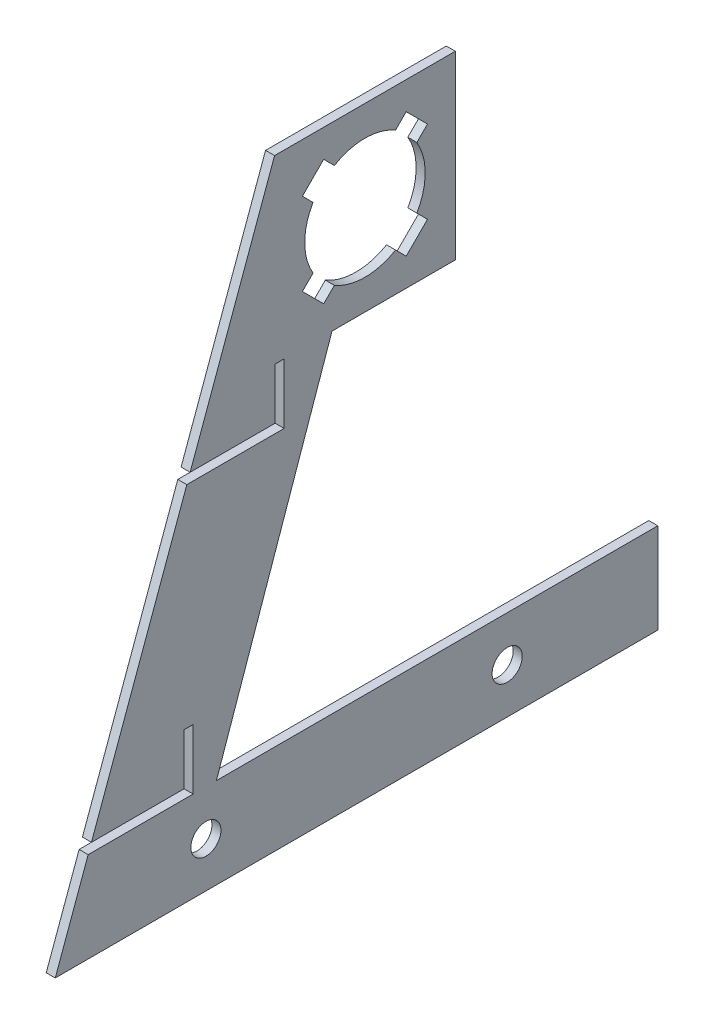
ISO-10303-21;
HEADER;
FILE_DESCRIPTION(('STEP AP214'),'2;1');
FILE_NAME('part.step','',(''),(''),'','','');
FILE_SCHEMA(('AUTOMOTIVE_DESIGN { 1 0 10303 214 1 1 1 1 }'));
ENDSEC;
DATA;
#1=APPLICATION_CONTEXT('core data for automotive mechanical design processes');
#2=APPLICATION_PROTOCOL_DEFINITION('international standard','automotive_design',2000,#1);
#3=PRODUCT_CONTEXT('',#1,'mechanical');
#4=PRODUCT('Part','Part','',(#3));
#5=PRODUCT_RELATED_PRODUCT_CATEGORY('part','',(#4));
#6=PRODUCT_DEFINITION_FORMATION('','',#4);
#7=PRODUCT_DEFINITION_CONTEXT('part definition',#1,'design');
#8=PRODUCT_DEFINITION('design','',#6,#7);
#9=PRODUCT_DEFINITION_SHAPE('','',#8);
#10=(LENGTH_UNIT() NAMED_UNIT(*) SI_UNIT(.MILLI.,.METRE.));
#11=(NAMED_UNIT(*) PLANE_ANGLE_UNIT() SI_UNIT($,.RADIAN.));
#12=(NAMED_UNIT(*) SI_UNIT($,.STERADIAN.) SOLID_ANGLE_UNIT());
#13=UNCERTAINTY_MEASURE_WITH_UNIT(LENGTH_MEASURE(1.E-05),#10,'distance_accuracy_value','');
#14=(GEOMETRIC_REPRESENTATION_CONTEXT(3) GLOBAL_UNCERTAINTY_ASSIGNED_CONTEXT((#13)) GLOBAL_UNIT_ASSIGNED_CONTEXT((#10,
#11,#12)) REPRESENTATION_CONTEXT('',''));
#15=CARTESIAN_POINT('',(0.,0.,0.));
#16=DIRECTION('',(0.,0.,1.));
#17=DIRECTION('',(1.,0.,0.));
#18=AXIS2_PLACEMENT_3D('',#15,#16,#17);
#19=CARTESIAN_POINT('',(3.,-88.2763451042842,-79.4280816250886));
#20=DIRECTION('',(-1.,0.,0.));
#21=DIRECTION('',(0.,0.,1.));
#22=AXIS2_PLACEMENT_3D('',#19,#20,#21);
#23=PLANE('',#22);
#24=CARTESIAN_POINT('',(3.,-73.2763451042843,-29.4280816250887));
#25=DIRECTION('',(1.,0.,0.));
#26=DIRECTION('',(0.,0.,-1.));
#27=AXIS2_PLACEMENT_3D('',#24,#25,#26);
#28=CIRCLE('',#27,5.);
#29=CARTESIAN_POINT('',(3.,-73.2763451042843,-34.4280816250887));
#30=VERTEX_POINT('',#29);
#31=EDGE_CURVE('E320',#30,#30,#28,.T.);
#32=ORIENTED_EDGE('',*,*,#31,.F.);
#33=EDGE_LOOP('',(#32));
#34=FACE_BOUND('',#33,.T.);
#35=DIRECTION('',(0.,1.,0.));
#36=VECTOR('',#35,1.);
#37=CARTESIAN_POINT('',(3.,-58.2763451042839,-79.4280816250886));
#38=LINE('',#37,#36);
#39=CARTESIAN_POINT('',(3.,-88.2763451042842,-79.4280816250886));
#40=VERTEX_POINT('',#39);
#41=CARTESIAN_POINT('',(3.,-58.2763451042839,-79.4280816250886));
#42=VERTEX_POINT('',#41);
#43=EDGE_CURVE('E390',#40,#42,#38,.T.);
#44=ORIENTED_EDGE('',*,*,#43,.T.);
#45=DIRECTION('',(0.,0.,1.));
#46=VECTOR('',#45,1.);
#47=CARTESIAN_POINT('',(3.,-58.2763451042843,67.0967277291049));
#48=LINE('',#47,#46);
#49=CARTESIAN_POINT('',(3.,-58.2763451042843,67.0967277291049));
#50=VERTEX_POINT('',#49);
#51=EDGE_CURVE('E393',#42,#50,#48,.T.);
#52=ORIENTED_EDGE('',*,*,#51,.T.);
#53=DIRECTION('',(0.,0.944189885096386,-0.329401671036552));
#54=VECTOR('',#53,1.);
#55=CARTESIAN_POINT('',(3.,-58.2763451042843,67.0967277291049));
#56=LINE('',#55,#54);
#57=CARTESIAN_POINT('',(3.,51.7539521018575,28.7102078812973));
#58=VERTEX_POINT('',#57);
#59=EDGE_CURVE('E396',#50,#58,#56,.T.);
#60=ORIENTED_EDGE('',*,*,#59,.T.);
#61=DIRECTION('',(0.,0.,-1.));
#62=VECTOR('',#61,1.);
#63=CARTESIAN_POINT('',(3.,51.7539521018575,-12.2221284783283));
#64=LINE('',#63,#62);
#65=CARTESIAN_POINT('',(3.,51.7539521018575,-12.2221284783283));
#66=VERTEX_POINT('',#65);
#67=EDGE_CURVE('E398',#58,#66,#64,.T.);
#68=ORIENTED_EDGE('',*,*,#67,.T.);
#69=DIRECTION('',(0.,1.,0.));
#70=VECTOR('',#69,1.);
#71=CARTESIAN_POINT('',(3.,111.753952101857,-12.2221284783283));
#72=LINE('',#71,#70);
#73=CARTESIAN_POINT('',(3.,111.753952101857,-12.2221284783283));
#74=VERTEX_POINT('',#73);
#75=EDGE_CURVE('E400',#66,#74,#72,.T.);
#76=ORIENTED_EDGE('',*,*,#75,.T.);
#77=DIRECTION('',(0.,0.,1.));
#78=VECTOR('',#77,1.);
#79=CARTESIAN_POINT('',(3.,111.753952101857,-12.2221284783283));
#80=LINE('',#79,#78);
#81=CARTESIAN_POINT('',(3.,111.753952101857,47.7778715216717));
#82=VERTEX_POINT('',#81);
#83=EDGE_CURVE('E402',#74,#82,#80,.T.);
#84=ORIENTED_EDGE('',*,*,#83,.T.);
#85=DIRECTION('',(0.,-0.93969262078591,0.342020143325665));
#86=VECTOR('',#85,1.);
#87=CARTESIAN_POINT('',(3.,34.7236548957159,75.8146068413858));
#88=LINE('',#87,#86);
#89=CARTESIAN_POINT('',(3.,34.7236548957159,75.8146068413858));
#90=VERTEX_POINT('',#89);
#91=EDGE_CURVE('E404',#82,#90,#88,.T.);
#92=ORIENTED_EDGE('',*,*,#91,.T.);
#93=DIRECTION('',(0.,0.,-1.));
#94=VECTOR('',#93,1.);
#95=CARTESIAN_POINT('',(3.,34.7236548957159,75.8146068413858));
#96=LINE('',#95,#94);
#97=CARTESIAN_POINT('',(3.,34.723654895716,47.5924058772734));
#98=VERTEX_POINT('',#97);
#99=EDGE_CURVE('E406',#90,#98,#96,.T.);
#100=ORIENTED_EDGE('',*,*,#99,.T.);
#101=DIRECTION('',(0.,1.,0.));
#102=VECTOR('',#101,1.);
#103=CARTESIAN_POINT('',(3.,51.723654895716,47.5924058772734));
#104=LINE('',#103,#102);
#105=CARTESIAN_POINT('',(3.,51.723654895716,47.5924058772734));
#106=VERTEX_POINT('',#105);
#107=EDGE_CURVE('E408',#98,#106,#104,.T.);
#108=ORIENTED_EDGE('',*,*,#107,.T.);
#109=DIRECTION('',(0.,0.,-1.));
#110=VECTOR('',#109,1.);
#111=CARTESIAN_POINT('',(3.,51.723654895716,44.5924058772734));
#112=LINE('',#111,#110);
#113=CARTESIAN_POINT('',(3.,51.723654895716,44.5924058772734));
#114=VERTEX_POINT('',#113);
#115=EDGE_CURVE('E410',#106,#114,#112,.T.);
#116=ORIENTED_EDGE('',*,*,#115,.T.);
#117=DIRECTION('',(0.,-1.,0.));
#118=VECTOR('',#117,1.);
#119=CARTESIAN_POINT('',(3.,51.723654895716,44.5924058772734));
#120=LINE('',#119,#118);
#121=CARTESIAN_POINT('',(3.,31.723654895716,44.5924058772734));
#122=VERTEX_POINT('',#121);
#123=EDGE_CURVE('E412',#114,#122,#120,.T.);
#124=ORIENTED_EDGE('',*,*,#123,.T.);
#125=DIRECTION('',(0.,0.,1.));
#126=VECTOR('',#125,1.);
#127=CARTESIAN_POINT('',(3.,31.723654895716,44.5924058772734));
#128=LINE('',#127,#126);
#129=CARTESIAN_POINT('',(3.,31.7236548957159,76.9065175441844));
#130=VERTEX_POINT('',#129);
#131=EDGE_CURVE('E414',#122,#130,#128,.T.);
#132=ORIENTED_EDGE('',*,*,#131,.T.);
#133=DIRECTION('',(0.,-0.93969262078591,0.342020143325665));
#134=VECTOR('',#133,1.);
#135=CARTESIAN_POINT('',(3.,-55.2763451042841,108.571927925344));
#136=LINE('',#135,#134);
#137=CARTESIAN_POINT('',(3.,-55.2763451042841,108.571927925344));
#138=VERTEX_POINT('',#137);
#139=EDGE_CURVE('E416',#130,#138,#136,.T.);
#140=ORIENTED_EDGE('',*,*,#139,.T.);
#141=DIRECTION('',(0.,0.,-1.));
#142=VECTOR('',#141,1.);
#143=CARTESIAN_POINT('',(3.,-55.2763451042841,77.8056090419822));
#144=LINE('',#143,#142);
#145=CARTESIAN_POINT('',(3.,-55.2763451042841,77.8056090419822));
#146=VERTEX_POINT('',#145);
#147=EDGE_CURVE('E418',#138,#146,#144,.T.);
#148=ORIENTED_EDGE('',*,*,#147,.T.);
#149=DIRECTION('',(0.,1.,0.));
#150=VECTOR('',#149,1.);
#151=CARTESIAN_POINT('',(3.,-38.276345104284,77.8056090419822));
#152=LINE('',#151,#150);
#153=CARTESIAN_POINT('',(3.,-38.276345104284,77.8056090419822));
#154=VERTEX_POINT('',#153);
#155=EDGE_CURVE('E420',#146,#154,#152,.T.);
#156=ORIENTED_EDGE('',*,*,#155,.T.);
#157=DIRECTION('',(0.,0.,-1.));
#158=VECTOR('',#157,1.);
#159=CARTESIAN_POINT('',(3.,-38.276345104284,74.8056090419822));
#160=LINE('',#159,#158);
#161=CARTESIAN_POINT('',(3.,-38.276345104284,74.8056090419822));
#162=VERTEX_POINT('',#161);
#163=EDGE_CURVE('E422',#154,#162,#160,.T.);
#164=ORIENTED_EDGE('',*,*,#163,.T.);
#165=DIRECTION('',(0.,-1.,0.));
#166=VECTOR('',#165,1.);
#167=CARTESIAN_POINT('',(3.,-58.2763451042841,74.8056090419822));
#168=LINE('',#167,#166);
#169=CARTESIAN_POINT('',(3.,-58.2763451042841,74.8056090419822));
#170=VERTEX_POINT('',#169);
#171=EDGE_CURVE('E424',#162,#170,#168,.T.);
#172=ORIENTED_EDGE('',*,*,#171,.T.);
#173=DIRECTION('',(0.,0.,1.));
#174=VECTOR('',#173,1.);
#175=CARTESIAN_POINT('',(3.,-58.2763451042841,74.8056090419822));
#176=LINE('',#175,#174);
#177=CARTESIAN_POINT('',(3.,-58.2763451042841,109.663838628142));
#178=VERTEX_POINT('',#177);
#179=EDGE_CURVE('E426',#170,#178,#176,.T.);
#180=ORIENTED_EDGE('',*,*,#179,.T.);
#181=DIRECTION('',(0.,-0.93969262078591,0.342020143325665));
#182=VECTOR('',#181,1.);
#183=CARTESIAN_POINT('',(3.,-88.2460478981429,120.571918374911));
#184=LINE('',#183,#182);
#185=CARTESIAN_POINT('',(3.,-88.2763451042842,120.582945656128));
#186=VERTEX_POINT('',#185);
#187=EDGE_CURVE('E428',#178,#186,#184,.T.);
#188=ORIENTED_EDGE('',*,*,#187,.T.);
#189=DIRECTION('',(0.,0.,-1.));
#190=VECTOR('',#189,1.);
#191=CARTESIAN_POINT('',(3.,-88.2763451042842,-79.4280816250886));
#192=LINE('',#191,#190);
#193=EDGE_CURVE('E430',#186,#40,#192,.T.);
#194=ORIENTED_EDGE('',*,*,#193,.T.);
#195=EDGE_LOOP('',(#44,#52,#60,#68,#76,#84,#92,#100,#108,#116,#124,#132,#140,#148,#156,#164,
#172,#180,#188,#194));
#196=FACE_BOUND('',#195,.T.);
#197=DIRECTION('',(0.,-0.707106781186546,-0.707106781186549));
#198=VECTOR('',#197,1.);
#199=CARTESIAN_POINT('',(3.,60.9898203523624,4.0848075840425));
#200=LINE('',#199,#198);
#201=CARTESIAN_POINT('',(3.,64.5253542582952,7.62034148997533));
#202=VERTEX_POINT('',#201);
#203=CARTESIAN_POINT('',(3.,60.9898203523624,4.0848075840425));
#204=VERTEX_POINT('',#203);
#205=EDGE_CURVE('E266',#202,#204,#200,.T.);
#206=ORIENTED_EDGE('',*,*,#205,.F.);
#207=CARTESIAN_POINT('',(3.,81.7539521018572,17.7778715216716));
#208=DIRECTION('',(1.,0.,0.));
#209=DIRECTION('',(0.,0.,-1.));
#210=AXIS2_PLACEMENT_3D('',#207,#208,#209);
#211=CIRCLE('',#210,20.);
#212=CARTESIAN_POINT('',(3.,64.5253542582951,27.9354015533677));
#213=VERTEX_POINT('',#212);
#214=EDGE_CURVE('E317',#213,#202,#211,.T.);
#215=ORIENTED_EDGE('',*,*,#214,.F.);
#216=DIRECTION('',(0.,0.707106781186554,-0.707106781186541));
#217=VECTOR('',#216,1.);
#218=CARTESIAN_POINT('',(3.,64.5253542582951,27.9354015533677));
#219=LINE('',#218,#217);
#220=CARTESIAN_POINT('',(3.,60.9898203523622,31.4709354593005));
#221=VERTEX_POINT('',#220);
#222=EDGE_CURVE('E315',#221,#213,#219,.T.);
#223=ORIENTED_EDGE('',*,*,#222,.F.);
#224=DIRECTION('',(0.,-0.707106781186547,-0.707106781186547));
#225=VECTOR('',#224,1.);
#226=CARTESIAN_POINT('',(3.,60.9898203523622,31.4709354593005));
#227=LINE('',#226,#225);
#228=CARTESIAN_POINT('',(3.,68.060888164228,38.5420032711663));
#229=VERTEX_POINT('',#228);
#230=EDGE_CURVE('E313',#229,#221,#227,.T.);
#231=ORIENTED_EDGE('',*,*,#230,.F.);
#232=DIRECTION('',(0.,-0.707106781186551,0.707106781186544));
#233=VECTOR('',#232,1.);
#234=CARTESIAN_POINT('',(3.,68.060888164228,38.5420032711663));
#235=LINE('',#234,#233);
#236=CARTESIAN_POINT('',(3.,71.5964220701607,35.0064693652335));
#237=VERTEX_POINT('',#236);
#238=EDGE_CURVE('E311',#237,#229,#235,.T.);
#239=ORIENTED_EDGE('',*,*,#238,.F.);
#240=CARTESIAN_POINT('',(3.,81.7539521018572,17.7778715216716));
#241=DIRECTION('',(1.,0.,0.));
#242=DIRECTION('',(0.,0.,-1.));
#243=AXIS2_PLACEMENT_3D('',#240,#241,#242);
#244=CIRCLE('',#243,20.);
#245=CARTESIAN_POINT('',(3.,91.9114821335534,35.0064693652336));
#246=VERTEX_POINT('',#245);
#247=EDGE_CURVE('E309',#246,#237,#244,.T.);
#248=ORIENTED_EDGE('',*,*,#247,.F.);
#249=DIRECTION('',(0.,-0.707106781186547,-0.707106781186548));
#250=VECTOR('',#249,1.);
#251=CARTESIAN_POINT('',(3.,91.9114821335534,35.0064693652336));
#252=LINE('',#251,#250);
#253=CARTESIAN_POINT('',(3.,95.4470160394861,38.5420032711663));
#254=VERTEX_POINT('',#253);
#255=EDGE_CURVE('E307',#254,#246,#252,.T.);
#256=ORIENTED_EDGE('',*,*,#255,.F.);
#257=DIRECTION('',(0.,-0.707106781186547,0.707106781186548));
#258=VECTOR('',#257,1.);
#259=CARTESIAN_POINT('',(3.,95.4470160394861,38.5420032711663));
#260=LINE('',#259,#258);
#261=CARTESIAN_POINT('',(3.,102.518083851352,31.4709354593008));
#262=VERTEX_POINT('',#261);
#263=EDGE_CURVE('E305',#262,#254,#260,.T.);
#264=ORIENTED_EDGE('',*,*,#263,.F.);
#265=DIRECTION('',(0.,0.707106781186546,0.707106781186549));
#266=VECTOR('',#265,1.);
#267=CARTESIAN_POINT('',(3.,98.982549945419,27.9354015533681));
#268=LINE('',#267,#266);
#269=CARTESIAN_POINT('',(3.,98.982549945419,27.9354015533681));
#270=VERTEX_POINT('',#269);
#271=EDGE_CURVE('E303',#270,#262,#268,.T.);
#272=ORIENTED_EDGE('',*,*,#271,.F.);
#273=CARTESIAN_POINT('',(3.,81.7539521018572,17.7778715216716));
#274=DIRECTION('',(1.,0.,0.));
#275=DIRECTION('',(0.,0.,-1.));
#276=AXIS2_PLACEMENT_3D('',#273,#274,#275);
#277=CIRCLE('',#276,20.);
#278=CARTESIAN_POINT('',(3.,98.9825499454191,7.62034148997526));
#279=VERTEX_POINT('',#278);
#280=EDGE_CURVE('E301',#279,#270,#277,.T.);
#281=ORIENTED_EDGE('',*,*,#280,.F.);
#282=DIRECTION('',(0.,-0.707106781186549,0.707106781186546));
#283=VECTOR('',#282,1.);
#284=CARTESIAN_POINT('',(3.,98.9825499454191,7.62034148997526));
#285=LINE('',#284,#283);
#286=CARTESIAN_POINT('',(3.,102.518083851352,4.08480758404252));
#287=VERTEX_POINT('',#286);
#288=EDGE_CURVE('E299',#287,#279,#285,.T.);
#289=ORIENTED_EDGE('',*,*,#288,.F.);
#290=DIRECTION('',(0.,0.707106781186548,0.707106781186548));
#291=VECTOR('',#290,1.);
#292=CARTESIAN_POINT('',(3.,95.4470160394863,-2.98626022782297));
#293=LINE('',#292,#291);
#294=CARTESIAN_POINT('',(3.,95.4470160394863,-2.98626022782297));
#295=VERTEX_POINT('',#294);
#296=EDGE_CURVE('E297',#295,#287,#293,.T.);
#297=ORIENTED_EDGE('',*,*,#296,.F.);
#298=DIRECTION('',(0.,0.707106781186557,-0.707106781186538));
#299=VECTOR('',#298,1.);
#300=CARTESIAN_POINT('',(3.,95.4470160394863,-2.98626022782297));
#301=LINE('',#300,#299);
#302=CARTESIAN_POINT('',(3.,91.9114821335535,0.549273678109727));
#303=VERTEX_POINT('',#302);
#304=EDGE_CURVE('E295',#303,#295,#301,.T.);
#305=ORIENTED_EDGE('',*,*,#304,.F.);
#306=CARTESIAN_POINT('',(3.,81.7539521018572,17.7778715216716));
#307=DIRECTION('',(1.,0.,0.));
#308=DIRECTION('',(0.,0.,-1.));
#309=AXIS2_PLACEMENT_3D('',#306,#307,#308);
#310=CIRCLE('',#309,20.);
#311=CARTESIAN_POINT('',(3.,71.5964220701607,0.549273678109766));
#312=VERTEX_POINT('',#311);
#313=EDGE_CURVE('E290',#312,#303,#310,.T.);
#314=ORIENTED_EDGE('',*,*,#313,.F.);
#315=DIRECTION('',(0.,0.707106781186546,0.707106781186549));
#316=VECTOR('',#315,1.);
#317=CARTESIAN_POINT('',(3.,68.060888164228,-2.98626022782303));
#318=LINE('',#317,#316);
#319=CARTESIAN_POINT('',(3.,68.060888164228,-2.98626022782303));
#320=VERTEX_POINT('',#319);
#321=EDGE_CURVE('E288',#320,#312,#318,.T.);
#322=ORIENTED_EDGE('',*,*,#321,.F.);
#323=DIRECTION('',(0.,0.707106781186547,-0.707106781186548));
#324=VECTOR('',#323,1.);
#325=CARTESIAN_POINT('',(3.,68.060888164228,-2.98626022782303));
#326=LINE('',#325,#324);
#327=EDGE_CURVE('E274',#204,#320,#326,.T.);
#328=ORIENTED_EDGE('',*,*,#327,.F.);
#329=EDGE_LOOP('',(#206,#215,#223,#231,#239,#248,#256,#264,#272,#281,#289,#297,#305,#314,#322,#328));
#330=FACE_BOUND('',#329,.T.);
#331=CARTESIAN_POINT('',(3.,-73.2763451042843,70.5719183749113));
#332=DIRECTION('',(1.,0.,0.));
#333=DIRECTION('',(0.,0.,-1.));
#334=AXIS2_PLACEMENT_3D('',#331,#332,#333);
#335=CIRCLE('',#334,5.00000000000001);
#336=CARTESIAN_POINT('',(3.,-73.2763451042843,65.5719183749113));
#337=VERTEX_POINT('',#336);
#338=EDGE_CURVE('E984',#337,#337,#335,.T.);
#339=ORIENTED_EDGE('',*,*,#338,.F.);
#340=EDGE_LOOP('',(#339));
#341=FACE_BOUND('',#340,.T.);
#342=ADVANCED_FACE('F33',(#34,#196,#330,#341),#23,.F.);
#343=CARTESIAN_POINT('',(0.,-88.2763451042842,-79.4280816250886));
#344=DIRECTION('',(-1.,0.,0.));
#345=DIRECTION('',(0.,0.,1.));
#346=AXIS2_PLACEMENT_3D('',#343,#344,#345);
#347=PLANE('',#346);
#348=CARTESIAN_POINT('',(0.,-73.2763451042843,-29.4280816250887));
#349=DIRECTION('',(1.,0.,0.));
#350=DIRECTION('',(0.,0.,-1.));
#351=AXIS2_PLACEMENT_3D('',#348,#349,#350);
#352=CIRCLE('',#351,5.);
#353=CARTESIAN_POINT('',(0.,-73.2763451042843,-34.4280816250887));
#354=VERTEX_POINT('',#353);
#355=EDGE_CURVE('E990',#354,#354,#352,.T.);
#356=ORIENTED_EDGE('',*,*,#355,.T.);
#357=EDGE_LOOP('',(#356));
#358=FACE_BOUND('',#357,.T.);
#359=DIRECTION('',(0.,1.,0.));
#360=VECTOR('',#359,1.);
#361=CARTESIAN_POINT('',(0.,-58.2763451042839,-79.4280816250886));
#362=LINE('',#361,#360);
#363=CARTESIAN_POINT('',(0.,-88.2763451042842,-79.4280816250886));
#364=VERTEX_POINT('',#363);
#365=CARTESIAN_POINT('',(0.,-58.2763451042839,-79.4280816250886));
#366=VERTEX_POINT('',#365);
#367=EDGE_CURVE('E282',#364,#366,#362,.T.);
#368=ORIENTED_EDGE('',*,*,#367,.F.);
#369=DIRECTION('',(0.,0.,-1.));
#370=VECTOR('',#369,1.);
#371=CARTESIAN_POINT('',(0.,-88.2763451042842,-79.4280816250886));
#372=LINE('',#371,#370);
#373=CARTESIAN_POINT('',(0.,-88.2763451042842,120.582945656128));
#374=VERTEX_POINT('',#373);
#375=EDGE_CURVE('E394',#374,#364,#372,.T.);
#376=ORIENTED_EDGE('',*,*,#375,.F.);
#377=DIRECTION('',(0.,-0.939692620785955,0.342020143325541));
#378=VECTOR('',#377,1.);
#379=CARTESIAN_POINT('',(0.,-88.2460478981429,120.571918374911));
#380=LINE('',#379,#378);
#381=CARTESIAN_POINT('',(0.,-58.2763451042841,109.663838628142));
#382=VERTEX_POINT('',#381);
#383=EDGE_CURVE('E470',#382,#374,#380,.T.);
#384=ORIENTED_EDGE('',*,*,#383,.F.);
#385=DIRECTION('',(0.,0.,1.));
#386=VECTOR('',#385,1.);
#387=CARTESIAN_POINT('',(0.,-58.2763451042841,74.8056090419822));
#388=LINE('',#387,#386);
#389=CARTESIAN_POINT('',(0.,-58.2763451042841,74.8056090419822));
#390=VERTEX_POINT('',#389);
#391=EDGE_CURVE('E467',#390,#382,#388,.T.);
#392=ORIENTED_EDGE('',*,*,#391,.F.);
#393=DIRECTION('',(0.,-1.,0.));
#394=VECTOR('',#393,1.);
#395=CARTESIAN_POINT('',(0.,-58.2763451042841,74.8056090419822));
#396=LINE('',#395,#394);
#397=CARTESIAN_POINT('',(0.,-38.276345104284,74.8056090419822));
#398=VERTEX_POINT('',#397);
#399=EDGE_CURVE('E465',#398,#390,#396,.T.);
#400=ORIENTED_EDGE('',*,*,#399,.F.);
#401=DIRECTION('',(0.,0.,-1.));
#402=VECTOR('',#401,1.);
#403=CARTESIAN_POINT('',(0.,-38.276345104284,74.8056090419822));
#404=LINE('',#403,#402);
#405=CARTESIAN_POINT('',(0.,-38.276345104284,77.8056090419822));
#406=VERTEX_POINT('',#405);
#407=EDGE_CURVE('E463',#406,#398,#404,.T.);
#408=ORIENTED_EDGE('',*,*,#407,.F.);
#409=DIRECTION('',(0.,1.,0.));
#410=VECTOR('',#409,1.);
#411=CARTESIAN_POINT('',(0.,-38.276345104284,77.8056090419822));
#412=LINE('',#411,#410);
#413=CARTESIAN_POINT('',(0.,-55.2763451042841,77.8056090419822));
#414=VERTEX_POINT('',#413);
#415=EDGE_CURVE('E461',#414,#406,#412,.T.);
#416=ORIENTED_EDGE('',*,*,#415,.F.);
#417=DIRECTION('',(0.,0.,-1.));
#418=VECTOR('',#417,1.);
#419=CARTESIAN_POINT('',(0.,-55.2763451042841,77.8056090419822));
#420=LINE('',#419,#418);
#421=CARTESIAN_POINT('',(0.,-55.2763451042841,108.571927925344));
#422=VERTEX_POINT('',#421);
#423=EDGE_CURVE('E459',#422,#414,#420,.T.);
#424=ORIENTED_EDGE('',*,*,#423,.F.);
#425=DIRECTION('',(0.,-0.93969262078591,0.342020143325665));
#426=VECTOR('',#425,1.);
#427=CARTESIAN_POINT('',(0.,-55.2763451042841,108.571927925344));
#428=LINE('',#427,#426);
#429=CARTESIAN_POINT('',(0.,31.7236548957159,76.9065175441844));
#430=VERTEX_POINT('',#429);
#431=EDGE_CURVE('E457',#430,#422,#428,.T.);
#432=ORIENTED_EDGE('',*,*,#431,.F.);
#433=DIRECTION('',(0.,0.,1.));
#434=VECTOR('',#433,1.);
#435=CARTESIAN_POINT('',(0.,31.723654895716,44.5924058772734));
#436=LINE('',#435,#434);
#437=CARTESIAN_POINT('',(0.,31.723654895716,44.5924058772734));
#438=VERTEX_POINT('',#437);
#439=EDGE_CURVE('E455',#438,#430,#436,.T.);
#440=ORIENTED_EDGE('',*,*,#439,.F.);
#441=DIRECTION('',(0.,-1.,0.));
#442=VECTOR('',#441,1.);
#443=CARTESIAN_POINT('',(0.,51.723654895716,44.5924058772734));
#444=LINE('',#443,#442);
#445=CARTESIAN_POINT('',(0.,51.723654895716,44.5924058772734));
#446=VERTEX_POINT('',#445);
#447=EDGE_CURVE('E453',#446,#438,#444,.T.);
#448=ORIENTED_EDGE('',*,*,#447,.F.);
#449=DIRECTION('',(0.,0.,-1.));
#450=VECTOR('',#449,1.);
#451=CARTESIAN_POINT('',(0.,51.723654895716,44.5924058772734));
#452=LINE('',#451,#450);
#453=CARTESIAN_POINT('',(0.,51.723654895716,47.5924058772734));
#454=VERTEX_POINT('',#453);
#455=EDGE_CURVE('E451',#454,#446,#452,.T.);
#456=ORIENTED_EDGE('',*,*,#455,.F.);
#457=DIRECTION('',(0.,1.,0.));
#458=VECTOR('',#457,1.);
#459=CARTESIAN_POINT('',(0.,51.723654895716,47.5924058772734));
#460=LINE('',#459,#458);
#461=CARTESIAN_POINT('',(0.,34.723654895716,47.5924058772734));
#462=VERTEX_POINT('',#461);
#463=EDGE_CURVE('E449',#462,#454,#460,.T.);
#464=ORIENTED_EDGE('',*,*,#463,.F.);
#465=DIRECTION('',(0.,0.,-1.));
#466=VECTOR('',#465,1.);
#467=CARTESIAN_POINT('',(0.,34.7236548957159,75.8146068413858));
#468=LINE('',#467,#466);
#469=CARTESIAN_POINT('',(0.,34.7236548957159,75.8146068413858));
#470=VERTEX_POINT('',#469);
#471=EDGE_CURVE('E447',#470,#462,#468,.T.);
#472=ORIENTED_EDGE('',*,*,#471,.F.);
#473=DIRECTION('',(0.,-0.93969262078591,0.342020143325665));
#474=VECTOR('',#473,1.);
#475=CARTESIAN_POINT('',(0.,34.7236548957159,75.8146068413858));
#476=LINE('',#475,#474);
#477=CARTESIAN_POINT('',(0.,111.753952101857,47.7778715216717));
#478=VERTEX_POINT('',#477);
#479=EDGE_CURVE('E445',#478,#470,#476,.T.);
#480=ORIENTED_EDGE('',*,*,#479,.F.);
#481=DIRECTION('',(0.,0.,1.));
#482=VECTOR('',#481,1.);
#483=CARTESIAN_POINT('',(0.,111.753952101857,-12.2221284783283));
#484=LINE('',#483,#482);
#485=CARTESIAN_POINT('',(0.,111.753952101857,-12.2221284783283));
#486=VERTEX_POINT('',#485);
#487=EDGE_CURVE('E443',#486,#478,#484,.T.);
#488=ORIENTED_EDGE('',*,*,#487,.F.);
#489=DIRECTION('',(0.,1.,0.));
#490=VECTOR('',#489,1.);
#491=CARTESIAN_POINT('',(0.,111.753952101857,-12.2221284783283));
#492=LINE('',#491,#490);
#493=CARTESIAN_POINT('',(0.,51.7539521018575,-12.2221284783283));
#494=VERTEX_POINT('',#493);
#495=EDGE_CURVE('E441',#494,#486,#492,.T.);
#496=ORIENTED_EDGE('',*,*,#495,.F.);
#497=DIRECTION('',(0.,0.,-1.));
#498=VECTOR('',#497,1.);
#499=CARTESIAN_POINT('',(0.,51.7539521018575,-12.2221284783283));
#500=LINE('',#499,#498);
#501=CARTESIAN_POINT('',(0.,51.7539521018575,28.7102078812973));
#502=VERTEX_POINT('',#501);
#503=EDGE_CURVE('E439',#502,#494,#500,.T.);
#504=ORIENTED_EDGE('',*,*,#503,.F.);
#505=DIRECTION('',(0.,0.944189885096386,-0.329401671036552));
#506=VECTOR('',#505,1.);
#507=CARTESIAN_POINT('',(0.,-58.2763451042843,67.0967277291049));
#508=LINE('',#507,#506);
#509=CARTESIAN_POINT('',(0.,-58.2763451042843,67.0967277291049));
#510=VERTEX_POINT('',#509);
#511=EDGE_CURVE('E437',#510,#502,#508,.T.);
#512=ORIENTED_EDGE('',*,*,#511,.F.);
#513=DIRECTION('',(0.,0.,1.));
#514=VECTOR('',#513,1.);
#515=CARTESIAN_POINT('',(0.,-58.2763451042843,67.0967277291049));
#516=LINE('',#515,#514);
#517=EDGE_CURVE('E435',#366,#510,#516,.T.);
#518=ORIENTED_EDGE('',*,*,#517,.F.);
#519=EDGE_LOOP('',(#368,#376,#384,#392,#400,#408,#416,#424,#432,#440,#448,#456,#464,#472,#480,
#488,#496,#504,#512,#518));
#520=FACE_BOUND('',#519,.T.);
#521=CARTESIAN_POINT('',(0.,81.7539521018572,17.7778715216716));
#522=DIRECTION('',(1.,0.,0.));
#523=DIRECTION('',(0.,0.,-1.));
#524=AXIS2_PLACEMENT_3D('',#521,#522,#523);
#525=CIRCLE('',#524,20.);
#526=CARTESIAN_POINT('',(0.,64.5253542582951,27.9354015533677));
#527=VERTEX_POINT('',#526);
#528=CARTESIAN_POINT('',(0.,64.5253542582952,7.62034148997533));
#529=VERTEX_POINT('',#528);
#530=EDGE_CURVE('E275',#527,#529,#525,.T.);
#531=ORIENTED_EDGE('',*,*,#530,.T.);
#532=DIRECTION('',(0.,-0.707106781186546,-0.707106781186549));
#533=VECTOR('',#532,1.);
#534=CARTESIAN_POINT('',(0.,60.9898203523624,4.0848075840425));
#535=LINE('',#534,#533);
#536=CARTESIAN_POINT('',(0.,60.9898203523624,4.0848075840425));
#537=VERTEX_POINT('',#536);
#538=EDGE_CURVE('E56',#529,#537,#535,.T.);
#539=ORIENTED_EDGE('',*,*,#538,.T.);
#540=DIRECTION('',(0.,0.707106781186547,-0.707106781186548));
#541=VECTOR('',#540,1.);
#542=CARTESIAN_POINT('',(0.,68.060888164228,-2.98626022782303));
#543=LINE('',#542,#541);
#544=CARTESIAN_POINT('',(0.,68.060888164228,-2.98626022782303));
#545=VERTEX_POINT('',#544);
#546=EDGE_CURVE('E281',#537,#545,#543,.T.);
#547=ORIENTED_EDGE('',*,*,#546,.T.);
#548=DIRECTION('',(0.,0.707106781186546,0.707106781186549));
#549=VECTOR('',#548,1.);
#550=CARTESIAN_POINT('',(0.,68.060888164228,-2.98626022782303));
#551=LINE('',#550,#549);
#552=CARTESIAN_POINT('',(0.,71.5964220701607,0.549273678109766));
#553=VERTEX_POINT('',#552);
#554=EDGE_CURVE('E322',#545,#553,#551,.T.);
#555=ORIENTED_EDGE('',*,*,#554,.T.);
#556=CARTESIAN_POINT('',(0.,81.7539521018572,17.7778715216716));
#557=DIRECTION('',(1.,0.,0.));
#558=DIRECTION('',(0.,0.,-1.));
#559=AXIS2_PLACEMENT_3D('',#556,#557,#558);
#560=CIRCLE('',#559,20.);
#561=CARTESIAN_POINT('',(0.,91.9114821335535,0.549273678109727));
#562=VERTEX_POINT('',#561);
#563=EDGE_CURVE('E325',#553,#562,#560,.T.);
#564=ORIENTED_EDGE('',*,*,#563,.T.);
#565=DIRECTION('',(0.,0.707106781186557,-0.707106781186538));
#566=VECTOR('',#565,1.);
#567=CARTESIAN_POINT('',(0.,95.4470160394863,-2.98626022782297));
#568=LINE('',#567,#566);
#569=CARTESIAN_POINT('',(0.,95.4470160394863,-2.98626022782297));
#570=VERTEX_POINT('',#569);
#571=EDGE_CURVE('E328',#562,#570,#568,.T.);
#572=ORIENTED_EDGE('',*,*,#571,.T.);
#573=DIRECTION('',(0.,0.707106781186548,0.707106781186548));
#574=VECTOR('',#573,1.);
#575=CARTESIAN_POINT('',(0.,95.4470160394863,-2.98626022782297));
#576=LINE('',#575,#574);
#577=CARTESIAN_POINT('',(0.,102.518083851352,4.08480758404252));
#578=VERTEX_POINT('',#577);
#579=EDGE_CURVE('E331',#570,#578,#576,.T.);
#580=ORIENTED_EDGE('',*,*,#579,.T.);
#581=DIRECTION('',(0.,-0.707106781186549,0.707106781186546));
#582=VECTOR('',#581,1.);
#583=CARTESIAN_POINT('',(0.,98.9825499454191,7.62034148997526));
#584=LINE('',#583,#582);
#585=CARTESIAN_POINT('',(0.,98.9825499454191,7.62034148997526));
#586=VERTEX_POINT('',#585);
#587=EDGE_CURVE('E334',#578,#586,#584,.T.);
#588=ORIENTED_EDGE('',*,*,#587,.T.);
#589=CARTESIAN_POINT('',(0.,81.7539521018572,17.7778715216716));
#590=DIRECTION('',(1.,0.,0.));
#591=DIRECTION('',(0.,0.,-1.));
#592=AXIS2_PLACEMENT_3D('',#589,#590,#591);
#593=CIRCLE('',#592,20.);
#594=CARTESIAN_POINT('',(0.,98.982549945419,27.9354015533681));
#595=VERTEX_POINT('',#594);
#596=EDGE_CURVE('E337',#586,#595,#593,.T.);
#597=ORIENTED_EDGE('',*,*,#596,.T.);
#598=DIRECTION('',(0.,0.707106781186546,0.707106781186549));
#599=VECTOR('',#598,1.);
#600=CARTESIAN_POINT('',(0.,98.982549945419,27.9354015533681));
#601=LINE('',#600,#599);
#602=CARTESIAN_POINT('',(0.,102.518083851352,31.4709354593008));
#603=VERTEX_POINT('',#602);
#604=EDGE_CURVE('E340',#595,#603,#601,.T.);
#605=ORIENTED_EDGE('',*,*,#604,.T.);
#606=DIRECTION('',(0.,-0.707106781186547,0.707106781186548));
#607=VECTOR('',#606,1.);
#608=CARTESIAN_POINT('',(0.,95.4470160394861,38.5420032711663));
#609=LINE('',#608,#607);
#610=CARTESIAN_POINT('',(0.,95.4470160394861,38.5420032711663));
#611=VERTEX_POINT('',#610);
#612=EDGE_CURVE('E343',#603,#611,#609,.T.);
#613=ORIENTED_EDGE('',*,*,#612,.T.);
#614=DIRECTION('',(0.,-0.707106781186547,-0.707106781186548));
#615=VECTOR('',#614,1.);
#616=CARTESIAN_POINT('',(0.,91.9114821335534,35.0064693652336));
#617=LINE('',#616,#615);
#618=CARTESIAN_POINT('',(0.,91.9114821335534,35.0064693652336));
#619=VERTEX_POINT('',#618);
#620=EDGE_CURVE('E346',#611,#619,#617,.T.);
#621=ORIENTED_EDGE('',*,*,#620,.T.);
#622=CARTESIAN_POINT('',(0.,81.7539521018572,17.7778715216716));
#623=DIRECTION('',(1.,0.,0.));
#624=DIRECTION('',(0.,0.,-1.));
#625=AXIS2_PLACEMENT_3D('',#622,#623,#624);
#626=CIRCLE('',#625,20.);
#627=CARTESIAN_POINT('',(0.,71.5964220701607,35.0064693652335));
#628=VERTEX_POINT('',#627);
#629=EDGE_CURVE('E349',#619,#628,#626,.T.);
#630=ORIENTED_EDGE('',*,*,#629,.T.);
#631=DIRECTION('',(0.,-0.707106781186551,0.707106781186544));
#632=VECTOR('',#631,1.);
#633=CARTESIAN_POINT('',(0.,68.060888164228,38.5420032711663));
#634=LINE('',#633,#632);
#635=CARTESIAN_POINT('',(0.,68.060888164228,38.5420032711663));
#636=VERTEX_POINT('',#635);
#637=EDGE_CURVE('E352',#628,#636,#634,.T.);
#638=ORIENTED_EDGE('',*,*,#637,.T.);
#639=DIRECTION('',(0.,-0.707106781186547,-0.707106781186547));
#640=VECTOR('',#639,1.);
#641=CARTESIAN_POINT('',(0.,60.9898203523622,31.4709354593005));
#642=LINE('',#641,#640);
#643=CARTESIAN_POINT('',(0.,60.9898203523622,31.4709354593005));
#644=VERTEX_POINT('',#643);
#645=EDGE_CURVE('E355',#636,#644,#642,.T.);
#646=ORIENTED_EDGE('',*,*,#645,.T.);
#647=DIRECTION('',(0.,0.707106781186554,-0.707106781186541));
#648=VECTOR('',#647,1.);
#649=CARTESIAN_POINT('',(0.,64.5253542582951,27.9354015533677));
#650=LINE('',#649,#648);
#651=EDGE_CURVE('E358',#644,#527,#650,.T.);
#652=ORIENTED_EDGE('',*,*,#651,.T.);
#653=EDGE_LOOP('',(#531,#539,#547,#555,#564,#572,#580,#588,#597,#605,#613,#621,#630,#638,#646,#652));
#654=FACE_BOUND('',#653,.T.);
#655=CARTESIAN_POINT('',(0.,-73.2763451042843,70.5719183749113));
#656=DIRECTION('',(1.,0.,0.));
#657=DIRECTION('',(0.,0.,-1.));
#658=AXIS2_PLACEMENT_3D('',#655,#656,#657);
#659=CIRCLE('',#658,5.00000000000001);
#660=CARTESIAN_POINT('',(0.,-73.2763451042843,65.5719183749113));
#661=VERTEX_POINT('',#660);
#662=EDGE_CURVE('E987',#661,#661,#659,.T.);
#663=ORIENTED_EDGE('',*,*,#662,.T.);
#664=EDGE_LOOP('',(#663));
#665=FACE_BOUND('',#664,.T.);
#666=ADVANCED_FACE('F536',(#358,#520,#654,#665),#347,.T.);
#667=CARTESIAN_POINT('',(3.,-58.2763451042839,-79.4280816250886));
#668=DIRECTION('',(0.,0.,1.));
#669=DIRECTION('',(1.,0.,0.));
#670=AXIS2_PLACEMENT_3D('',#667,#668,#669);
#671=PLANE('',#670);
#672=ORIENTED_EDGE('',*,*,#367,.T.);
#673=DIRECTION('',(-1.,0.,0.));
#674=VECTOR('',#673,1.);
#675=CARTESIAN_POINT('',(3.,-58.2763451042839,-79.4280816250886));
#676=LINE('',#675,#674);
#677=EDGE_CURVE('E11',#42,#366,#676,.T.);
#678=ORIENTED_EDGE('',*,*,#677,.F.);
#679=ORIENTED_EDGE('',*,*,#43,.F.);
#680=DIRECTION('',(-1.,0.,0.));
#681=VECTOR('',#680,1.);
#682=CARTESIAN_POINT('',(3.,-88.2763451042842,-79.4280816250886));
#683=LINE('',#682,#681);
#684=EDGE_CURVE('E432',#40,#364,#683,.T.);
#685=ORIENTED_EDGE('',*,*,#684,.T.);
#686=EDGE_LOOP('',(#672,#678,#679,#685));
#687=FACE_BOUND('',#686,.T.);
#688=ADVANCED_FACE('F35',(#687),#671,.F.);
#689=CARTESIAN_POINT('',(3.,-58.2763451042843,67.0967277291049));
#690=DIRECTION('',(0.,-1.,0.));
#691=DIRECTION('',(0.,0.,-1.));
#692=AXIS2_PLACEMENT_3D('',#689,#690,#691);
#693=PLANE('',#692);
#694=ORIENTED_EDGE('',*,*,#517,.T.);
#695=DIRECTION('',(-1.,0.,0.));
#696=VECTOR('',#695,1.);
#697=CARTESIAN_POINT('',(3.,-58.2763451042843,67.0967277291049));
#698=LINE('',#697,#696);
#699=EDGE_CURVE('E41',#50,#510,#698,.T.);
#700=ORIENTED_EDGE('',*,*,#699,.F.);
#701=ORIENTED_EDGE('',*,*,#51,.F.);
#702=ORIENTED_EDGE('',*,*,#677,.T.);
#703=EDGE_LOOP('',(#694,#700,#701,#702));
#704=FACE_BOUND('',#703,.T.);
#705=ADVANCED_FACE('F553',(#704),#693,.F.);
#706=CARTESIAN_POINT('',(3.,-58.2763451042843,67.0967277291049));
#707=DIRECTION('',(0.,0.329401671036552,0.944189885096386));
#708=DIRECTION('',(0.,-0.944189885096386,0.329401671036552));
#709=AXIS2_PLACEMENT_3D('',#706,#707,#708);
#710=PLANE('',#709);
#711=ORIENTED_EDGE('',*,*,#511,.T.);
#712=DIRECTION('',(-1.,0.,0.));
#713=VECTOR('',#712,1.);
#714=CARTESIAN_POINT('',(3.,51.7539521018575,28.7102078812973));
#715=LINE('',#714,#713);
#716=EDGE_CURVE('E523',#58,#502,#715,.T.);
#717=ORIENTED_EDGE('',*,*,#716,.F.);
#718=ORIENTED_EDGE('',*,*,#59,.F.);
#719=ORIENTED_EDGE('',*,*,#699,.T.);
#720=EDGE_LOOP('',(#711,#717,#718,#719));
#721=FACE_BOUND('',#720,.T.);
#722=ADVANCED_FACE('F530',(#721),#710,.F.);
#723=CARTESIAN_POINT('',(3.,51.7539521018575,-12.2221284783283));
#724=DIRECTION('',(0.,1.,0.));
#725=DIRECTION('',(0.,0.,1.));
#726=AXIS2_PLACEMENT_3D('',#723,#724,#725);
#727=PLANE('',#726);
#728=ORIENTED_EDGE('',*,*,#503,.T.);
#729=DIRECTION('',(-1.,0.,0.));
#730=VECTOR('',#729,1.);
#731=CARTESIAN_POINT('',(3.,51.7539521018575,-12.2221284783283));
#732=LINE('',#731,#730);
#733=EDGE_CURVE('E520',#66,#494,#732,.T.);
#734=ORIENTED_EDGE('',*,*,#733,.F.);
#735=ORIENTED_EDGE('',*,*,#67,.F.);
#736=ORIENTED_EDGE('',*,*,#716,.T.);
#737=EDGE_LOOP('',(#728,#734,#735,#736));
#738=FACE_BOUND('',#737,.T.);
#739=ADVANCED_FACE('F542',(#738),#727,.F.);
#740=CARTESIAN_POINT('',(3.,111.753952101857,-12.2221284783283));
#741=DIRECTION('',(0.,0.,1.));
#742=DIRECTION('',(0.,-1.,0.));
#743=AXIS2_PLACEMENT_3D('',#740,#741,#742);
#744=PLANE('',#743);
#745=ORIENTED_EDGE('',*,*,#495,.T.);
#746=DIRECTION('',(-1.,0.,0.));
#747=VECTOR('',#746,1.);
#748=CARTESIAN_POINT('',(3.,111.753952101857,-12.2221284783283));
#749=LINE('',#748,#747);
#750=EDGE_CURVE('E517',#74,#486,#749,.T.);
#751=ORIENTED_EDGE('',*,*,#750,.F.);
#752=ORIENTED_EDGE('',*,*,#75,.F.);
#753=ORIENTED_EDGE('',*,*,#733,.T.);
#754=EDGE_LOOP('',(#745,#751,#752,#753));
#755=FACE_BOUND('',#754,.T.);
#756=ADVANCED_FACE('F546',(#755),#744,.F.);
#757=CARTESIAN_POINT('',(3.,111.753952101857,-12.2221284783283));
#758=DIRECTION('',(0.,-1.,0.));
#759=DIRECTION('',(0.,0.,-1.));
#760=AXIS2_PLACEMENT_3D('',#757,#758,#759);
#761=PLANE('',#760);
#762=ORIENTED_EDGE('',*,*,#487,.T.);
#763=DIRECTION('',(-1.,0.,0.));
#764=VECTOR('',#763,1.);
#765=CARTESIAN_POINT('',(3.,111.753952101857,47.7778715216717));
#766=LINE('',#765,#764);
#767=EDGE_CURVE('E514',#82,#478,#766,.T.);
#768=ORIENTED_EDGE('',*,*,#767,.F.);
#769=ORIENTED_EDGE('',*,*,#83,.F.);
#770=ORIENTED_EDGE('',*,*,#750,.T.);
#771=EDGE_LOOP('',(#762,#768,#769,#770));
#772=FACE_BOUND('',#771,.T.);
#773=ADVANCED_FACE('F625',(#772),#761,.F.);
#774=CARTESIAN_POINT('',(3.,34.7236548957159,75.8146068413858));
#775=DIRECTION('',(0.,-0.342020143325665,-0.93969262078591));
#776=DIRECTION('',(0.,0.93969262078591,-0.342020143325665));
#777=AXIS2_PLACEMENT_3D('',#774,#775,#776);
#778=PLANE('',#777);
#779=ORIENTED_EDGE('',*,*,#479,.T.);
#780=DIRECTION('',(-1.,0.,0.));
#781=VECTOR('',#780,1.);
#782=CARTESIAN_POINT('',(3.,34.7236548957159,75.8146068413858));
#783=LINE('',#782,#781);
#784=EDGE_CURVE('E511',#90,#470,#783,.T.);
#785=ORIENTED_EDGE('',*,*,#784,.F.);
#786=ORIENTED_EDGE('',*,*,#91,.F.);
#787=ORIENTED_EDGE('',*,*,#767,.T.);
#788=EDGE_LOOP('',(#779,#785,#786,#787));
#789=FACE_BOUND('',#788,.T.);
#790=ADVANCED_FACE('F623',(#789),#778,.F.);
#791=CARTESIAN_POINT('',(3.,34.7236548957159,75.8146068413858));
#792=DIRECTION('',(0.,1.,0.));
#793=DIRECTION('',(0.,0.,1.));
#794=AXIS2_PLACEMENT_3D('',#791,#792,#793);
#795=PLANE('',#794);
#796=ORIENTED_EDGE('',*,*,#471,.T.);
#797=DIRECTION('',(-1.,0.,0.));
#798=VECTOR('',#797,1.);
#799=CARTESIAN_POINT('',(3.,34.723654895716,47.5924058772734));
#800=LINE('',#799,#798);
#801=EDGE_CURVE('E508',#98,#462,#800,.T.);
#802=ORIENTED_EDGE('',*,*,#801,.F.);
#803=ORIENTED_EDGE('',*,*,#99,.F.);
#804=ORIENTED_EDGE('',*,*,#784,.T.);
#805=EDGE_LOOP('',(#796,#802,#803,#804));
#806=FACE_BOUND('',#805,.T.);
#807=ADVANCED_FACE('F618',(#806),#795,.F.);
#808=CARTESIAN_POINT('',(3.,51.723654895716,47.5924058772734));
#809=DIRECTION('',(0.,0.,1.));
#810=DIRECTION('',(1.,0.,0.));
#811=AXIS2_PLACEMENT_3D('',#808,#809,#810);
#812=PLANE('',#811);
#813=ORIENTED_EDGE('',*,*,#463,.T.);
#814=DIRECTION('',(-1.,0.,0.));
#815=VECTOR('',#814,1.);
#816=CARTESIAN_POINT('',(3.,51.723654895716,47.5924058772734));
#817=LINE('',#816,#815);
#818=EDGE_CURVE('E505',#106,#454,#817,.T.);
#819=ORIENTED_EDGE('',*,*,#818,.F.);
#820=ORIENTED_EDGE('',*,*,#107,.F.);
#821=ORIENTED_EDGE('',*,*,#801,.T.);
#822=EDGE_LOOP('',(#813,#819,#820,#821));
#823=FACE_BOUND('',#822,.T.);
#824=ADVANCED_FACE('F613',(#823),#812,.F.);
#825=CARTESIAN_POINT('',(3.,51.723654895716,44.5924058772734));
#826=DIRECTION('',(0.,1.,0.));
#827=DIRECTION('',(0.,0.,1.));
#828=AXIS2_PLACEMENT_3D('',#825,#826,#827);
#829=PLANE('',#828);
#830=ORIENTED_EDGE('',*,*,#455,.T.);
#831=DIRECTION('',(-1.,0.,0.));
#832=VECTOR('',#831,1.);
#833=CARTESIAN_POINT('',(3.,51.723654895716,44.5924058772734));
#834=LINE('',#833,#832);
#835=EDGE_CURVE('E502',#114,#446,#834,.T.);
#836=ORIENTED_EDGE('',*,*,#835,.F.);
#837=ORIENTED_EDGE('',*,*,#115,.F.);
#838=ORIENTED_EDGE('',*,*,#818,.T.);
#839=EDGE_LOOP('',(#830,#836,#837,#838));
#840=FACE_BOUND('',#839,.T.);
#841=ADVANCED_FACE('F609',(#840),#829,.F.);
#842=CARTESIAN_POINT('',(3.,51.723654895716,44.5924058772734));
#843=DIRECTION('',(0.,0.,-1.));
#844=DIRECTION('',(0.,1.,0.));
#845=AXIS2_PLACEMENT_3D('',#842,#843,#844);
#846=PLANE('',#845);
#847=ORIENTED_EDGE('',*,*,#447,.T.);
#848=DIRECTION('',(-1.,0.,0.));
#849=VECTOR('',#848,1.);
#850=CARTESIAN_POINT('',(3.,31.723654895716,44.5924058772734));
#851=LINE('',#850,#849);
#852=EDGE_CURVE('E499',#122,#438,#851,.T.);
#853=ORIENTED_EDGE('',*,*,#852,.F.);
#854=ORIENTED_EDGE('',*,*,#123,.F.);
#855=ORIENTED_EDGE('',*,*,#835,.T.);
#856=EDGE_LOOP('',(#847,#853,#854,#855));
#857=FACE_BOUND('',#856,.T.);
#858=ADVANCED_FACE('F604',(#857),#846,.F.);
#859=CARTESIAN_POINT('',(3.,31.723654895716,44.5924058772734));
#860=DIRECTION('',(0.,-1.,0.));
#861=DIRECTION('',(0.,0.,-1.));
#862=AXIS2_PLACEMENT_3D('',#859,#860,#861);
#863=PLANE('',#862);
#864=ORIENTED_EDGE('',*,*,#439,.T.);
#865=DIRECTION('',(-1.,0.,0.));
#866=VECTOR('',#865,1.);
#867=CARTESIAN_POINT('',(3.,31.7236548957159,76.9065175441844));
#868=LINE('',#867,#866);
#869=EDGE_CURVE('E496',#130,#430,#868,.T.);
#870=ORIENTED_EDGE('',*,*,#869,.F.);
#871=ORIENTED_EDGE('',*,*,#131,.F.);
#872=ORIENTED_EDGE('',*,*,#852,.T.);
#873=EDGE_LOOP('',(#864,#870,#871,#872));
#874=FACE_BOUND('',#873,.T.);
#875=ADVANCED_FACE('F598',(#874),#863,.F.);
#876=CARTESIAN_POINT('',(3.,-55.2763451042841,108.571927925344));
#877=DIRECTION('',(0.,-0.342020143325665,-0.93969262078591));
#878=DIRECTION('',(0.,0.93969262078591,-0.342020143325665));
#879=AXIS2_PLACEMENT_3D('',#876,#877,#878);
#880=PLANE('',#879);
#881=ORIENTED_EDGE('',*,*,#431,.T.);
#882=DIRECTION('',(-1.,0.,0.));
#883=VECTOR('',#882,1.);
#884=CARTESIAN_POINT('',(3.,-55.2763451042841,108.571927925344));
#885=LINE('',#884,#883);
#886=EDGE_CURVE('E493',#138,#422,#885,.T.);
#887=ORIENTED_EDGE('',*,*,#886,.F.);
#888=ORIENTED_EDGE('',*,*,#139,.F.);
#889=ORIENTED_EDGE('',*,*,#869,.T.);
#890=EDGE_LOOP('',(#881,#887,#888,#889));
#891=FACE_BOUND('',#890,.T.);
#892=ADVANCED_FACE('F594',(#891),#880,.F.);
#893=CARTESIAN_POINT('',(3.,-55.2763451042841,77.8056090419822));
#894=DIRECTION('',(0.,1.,0.));
#895=DIRECTION('',(0.,0.,1.));
#896=AXIS2_PLACEMENT_3D('',#893,#894,#895);
#897=PLANE('',#896);
#898=ORIENTED_EDGE('',*,*,#423,.T.);
#899=DIRECTION('',(-1.,0.,0.));
#900=VECTOR('',#899,1.);
#901=CARTESIAN_POINT('',(3.,-55.2763451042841,77.8056090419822));
#902=LINE('',#901,#900);
#903=EDGE_CURVE('E490',#146,#414,#902,.T.);
#904=ORIENTED_EDGE('',*,*,#903,.F.);
#905=ORIENTED_EDGE('',*,*,#147,.F.);
#906=ORIENTED_EDGE('',*,*,#886,.T.);
#907=EDGE_LOOP('',(#898,#904,#905,#906));
#908=FACE_BOUND('',#907,.T.);
#909=ADVANCED_FACE('F589',(#908),#897,.F.);
#910=CARTESIAN_POINT('',(3.,-38.276345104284,77.8056090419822));
#911=DIRECTION('',(0.,0.,1.));
#912=DIRECTION('',(1.,0.,0.));
#913=AXIS2_PLACEMENT_3D('',#910,#911,#912);
#914=PLANE('',#913);
#915=ORIENTED_EDGE('',*,*,#415,.T.);
#916=DIRECTION('',(-1.,0.,0.));
#917=VECTOR('',#916,1.);
#918=CARTESIAN_POINT('',(3.,-38.276345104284,77.8056090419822));
#919=LINE('',#918,#917);
#920=EDGE_CURVE('E487',#154,#406,#919,.T.);
#921=ORIENTED_EDGE('',*,*,#920,.F.);
#922=ORIENTED_EDGE('',*,*,#155,.F.);
#923=ORIENTED_EDGE('',*,*,#903,.T.);
#924=EDGE_LOOP('',(#915,#921,#922,#923));
#925=FACE_BOUND('',#924,.T.);
#926=ADVANCED_FACE('F583',(#925),#914,.F.);
#927=CARTESIAN_POINT('',(3.,-38.276345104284,74.8056090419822));
#928=DIRECTION('',(0.,1.,0.));
#929=DIRECTION('',(0.,0.,1.));
#930=AXIS2_PLACEMENT_3D('',#927,#928,#929);
#931=PLANE('',#930);
#932=ORIENTED_EDGE('',*,*,#407,.T.);
#933=DIRECTION('',(-1.,0.,0.));
#934=VECTOR('',#933,1.);
#935=CARTESIAN_POINT('',(3.,-38.276345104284,74.8056090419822));
#936=LINE('',#935,#934);
#937=EDGE_CURVE('E484',#162,#398,#936,.T.);
#938=ORIENTED_EDGE('',*,*,#937,.F.);
#939=ORIENTED_EDGE('',*,*,#163,.F.);
#940=ORIENTED_EDGE('',*,*,#920,.T.);
#941=EDGE_LOOP('',(#932,#938,#939,#940));
#942=FACE_BOUND('',#941,.T.);
#943=ADVANCED_FACE('F579',(#942),#931,.F.);
#944=CARTESIAN_POINT('',(3.,-58.2763451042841,74.8056090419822));
#945=DIRECTION('',(0.,0.,-1.));
#946=DIRECTION('',(-1.,0.,0.));
#947=AXIS2_PLACEMENT_3D('',#944,#945,#946);
#948=PLANE('',#947);
#949=ORIENTED_EDGE('',*,*,#399,.T.);
#950=DIRECTION('',(-1.,0.,0.));
#951=VECTOR('',#950,1.);
#952=CARTESIAN_POINT('',(3.,-58.2763451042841,74.8056090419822));
#953=LINE('',#952,#951);
#954=EDGE_CURVE('E481',#170,#390,#953,.T.);
#955=ORIENTED_EDGE('',*,*,#954,.F.);
#956=ORIENTED_EDGE('',*,*,#171,.F.);
#957=ORIENTED_EDGE('',*,*,#937,.T.);
#958=EDGE_LOOP('',(#949,#955,#956,#957));
#959=FACE_BOUND('',#958,.T.);
#960=ADVANCED_FACE('F574',(#959),#948,.F.);
#961=CARTESIAN_POINT('',(3.,-58.2763451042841,74.8056090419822));
#962=DIRECTION('',(0.,-1.,0.));
#963=DIRECTION('',(0.,0.,-1.));
#964=AXIS2_PLACEMENT_3D('',#961,#962,#963);
#965=PLANE('',#964);
#966=ORIENTED_EDGE('',*,*,#391,.T.);
#967=DIRECTION('',(-1.,0.,0.));
#968=VECTOR('',#967,1.);
#969=CARTESIAN_POINT('',(3.,-58.2763451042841,109.663838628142));
#970=LINE('',#969,#968);
#971=EDGE_CURVE('E478',#178,#382,#970,.T.);
#972=ORIENTED_EDGE('',*,*,#971,.F.);
#973=ORIENTED_EDGE('',*,*,#179,.F.);
#974=ORIENTED_EDGE('',*,*,#954,.T.);
#975=EDGE_LOOP('',(#966,#972,#973,#974));
#976=FACE_BOUND('',#975,.T.);
#977=ADVANCED_FACE('F568',(#976),#965,.F.);
#978=CARTESIAN_POINT('',(3.,-88.2460478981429,120.571918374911));
#979=DIRECTION('',(0.,-0.342020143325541,-0.939692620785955));
#980=DIRECTION('',(0.,0.939692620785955,-0.342020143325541));
#981=AXIS2_PLACEMENT_3D('',#978,#979,#980);
#982=PLANE('',#981);
#983=ORIENTED_EDGE('',*,*,#383,.T.);
#984=DIRECTION('',(-1.,0.,0.));
#985=VECTOR('',#984,1.);
#986=CARTESIAN_POINT('',(3.,-88.2763451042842,120.582945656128));
#987=LINE('',#986,#985);
#988=EDGE_CURVE('E475',#186,#374,#987,.T.);
#989=ORIENTED_EDGE('',*,*,#988,.F.);
#990=ORIENTED_EDGE('',*,*,#187,.F.);
#991=ORIENTED_EDGE('',*,*,#971,.T.);
#992=EDGE_LOOP('',(#983,#989,#990,#991));
#993=FACE_BOUND('',#992,.T.);
#994=ADVANCED_FACE('F564',(#993),#982,.F.);
#995=CARTESIAN_POINT('',(3.,-88.2763451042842,-79.4280816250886));
#996=DIRECTION('',(0.,1.,0.));
#997=DIRECTION('',(0.,0.,1.));
#998=AXIS2_PLACEMENT_3D('',#995,#996,#997);
#999=PLANE('',#998);
#1000=ORIENTED_EDGE('',*,*,#375,.T.);
#1001=ORIENTED_EDGE('',*,*,#684,.F.);
#1002=ORIENTED_EDGE('',*,*,#193,.F.);
#1003=ORIENTED_EDGE('',*,*,#988,.T.);
#1004=EDGE_LOOP('',(#1000,#1001,#1002,#1003));
#1005=FACE_BOUND('',#1004,.T.);
#1006=ADVANCED_FACE('F559',(#1005),#999,.F.);
#1007=CARTESIAN_POINT('',(3.,60.9898203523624,4.0848075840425));
#1008=DIRECTION('',(0.,0.707106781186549,-0.707106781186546));
#1009=DIRECTION('',(0.,0.707106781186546,0.707106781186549));
#1010=AXIS2_PLACEMENT_3D('',#1007,#1008,#1009);
#1011=PLANE('',#1010);
#1012=ORIENTED_EDGE('',*,*,#538,.F.);
#1013=DIRECTION('',(-1.,0.,0.));
#1014=VECTOR('',#1013,1.);
#1015=CARTESIAN_POINT('',(3.,64.5253542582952,7.62034148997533));
#1016=LINE('',#1015,#1014);
#1017=EDGE_CURVE('E270',#202,#529,#1016,.T.);
#1018=ORIENTED_EDGE('',*,*,#1017,.F.);
#1019=ORIENTED_EDGE('',*,*,#205,.T.);
#1020=DIRECTION('',(-1.,0.,0.));
#1021=VECTOR('',#1020,1.);
#1022=CARTESIAN_POINT('',(3.,60.9898203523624,4.0848075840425));
#1023=LINE('',#1022,#1021);
#1024=EDGE_CURVE('E269',#204,#537,#1023,.T.);
#1025=ORIENTED_EDGE('',*,*,#1024,.T.);
#1026=EDGE_LOOP('',(#1012,#1018,#1019,#1025));
#1027=FACE_BOUND('',#1026,.T.);
#1028=ADVANCED_FACE('F268',(#1027),#1011,.T.);
#1029=CARTESIAN_POINT('',(3.,68.060888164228,-2.98626022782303));
#1030=DIRECTION('',(0.,0.707106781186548,0.707106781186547));
#1031=DIRECTION('',(0.,-0.707106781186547,0.707106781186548));
#1032=AXIS2_PLACEMENT_3D('',#1029,#1030,#1031);
#1033=PLANE('',#1032);
#1034=ORIENTED_EDGE('',*,*,#546,.F.);
#1035=ORIENTED_EDGE('',*,*,#1024,.F.);
#1036=ORIENTED_EDGE('',*,*,#327,.T.);
#1037=DIRECTION('',(-1.,0.,0.));
#1038=VECTOR('',#1037,1.);
#1039=CARTESIAN_POINT('',(3.,68.060888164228,-2.98626022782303));
#1040=LINE('',#1039,#1038);
#1041=EDGE_CURVE('E283',#320,#545,#1040,.T.);
#1042=ORIENTED_EDGE('',*,*,#1041,.T.);
#1043=EDGE_LOOP('',(#1034,#1035,#1036,#1042));
#1044=FACE_BOUND('',#1043,.T.);
#1045=ADVANCED_FACE('F278',(#1044),#1033,.T.);
#1046=CARTESIAN_POINT('',(3.,68.060888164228,-2.98626022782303));
#1047=DIRECTION('',(0.,-0.707106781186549,0.707106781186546));
#1048=DIRECTION('',(0.,-0.707106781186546,-0.707106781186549));
#1049=AXIS2_PLACEMENT_3D('',#1046,#1047,#1048);
#1050=PLANE('',#1049);
#1051=ORIENTED_EDGE('',*,*,#554,.F.);
#1052=ORIENTED_EDGE('',*,*,#1041,.F.);
#1053=ORIENTED_EDGE('',*,*,#321,.T.);
#1054=DIRECTION('',(-1.,0.,0.));
#1055=VECTOR('',#1054,1.);
#1056=CARTESIAN_POINT('',(3.,71.5964220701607,0.549273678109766));
#1057=LINE('',#1056,#1055);
#1058=EDGE_CURVE('E387',#312,#553,#1057,.T.);
#1059=ORIENTED_EDGE('',*,*,#1058,.T.);
#1060=EDGE_LOOP('',(#1051,#1052,#1053,#1059));
#1061=FACE_BOUND('',#1060,.T.);
#1062=ADVANCED_FACE('F734',(#1061),#1050,.T.);
#1063=CARTESIAN_POINT('',(3.,81.7539521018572,17.7778715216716));
#1064=DIRECTION('',(-1.,0.,0.));
#1065=DIRECTION('',(0.,0.,1.));
#1066=AXIS2_PLACEMENT_3D('',#1063,#1064,#1065);
#1067=CYLINDRICAL_SURFACE('',#1066,20.);
#1068=ORIENTED_EDGE('',*,*,#563,.F.);
#1069=ORIENTED_EDGE('',*,*,#1058,.F.);
#1070=ORIENTED_EDGE('',*,*,#313,.T.);
#1071=DIRECTION('',(-1.,0.,0.));
#1072=VECTOR('',#1071,1.);
#1073=CARTESIAN_POINT('',(3.,91.9114821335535,0.549273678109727));
#1074=LINE('',#1073,#1072);
#1075=EDGE_CURVE('E385',#303,#562,#1074,.T.);
#1076=ORIENTED_EDGE('',*,*,#1075,.T.);
#1077=EDGE_LOOP('',(#1068,#1069,#1070,#1076));
#1078=FACE_BOUND('',#1077,.T.);
#1079=ADVANCED_FACE('F740',(#1078),#1067,.F.);
#1080=CARTESIAN_POINT('',(3.,95.4470160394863,-2.98626022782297));
#1081=DIRECTION('',(0.,0.707106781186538,0.707106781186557));
#1082=DIRECTION('',(0.,-0.707106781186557,0.707106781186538));
#1083=AXIS2_PLACEMENT_3D('',#1080,#1081,#1082);
#1084=PLANE('',#1083);
#1085=ORIENTED_EDGE('',*,*,#571,.F.);
#1086=ORIENTED_EDGE('',*,*,#1075,.F.);
#1087=ORIENTED_EDGE('',*,*,#304,.T.);
#1088=DIRECTION('',(-1.,0.,0.));
#1089=VECTOR('',#1088,1.);
#1090=CARTESIAN_POINT('',(3.,95.4470160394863,-2.98626022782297));
#1091=LINE('',#1090,#1089);
#1092=EDGE_CURVE('E383',#295,#570,#1091,.T.);
#1093=ORIENTED_EDGE('',*,*,#1092,.T.);
#1094=EDGE_LOOP('',(#1085,#1086,#1087,#1093));
#1095=FACE_BOUND('',#1094,.T.);
#1096=ADVANCED_FACE('F748',(#1095),#1084,.T.);
#1097=CARTESIAN_POINT('',(3.,95.4470160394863,-2.98626022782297));
#1098=DIRECTION('',(0.,-0.707106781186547,0.707106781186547));
#1099=DIRECTION('',(0.,-0.707106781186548,-0.707106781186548));
#1100=AXIS2_PLACEMENT_3D('',#1097,#1098,#1099);
#1101=PLANE('',#1100);
#1102=ORIENTED_EDGE('',*,*,#579,.F.);
#1103=ORIENTED_EDGE('',*,*,#1092,.F.);
#1104=ORIENTED_EDGE('',*,*,#296,.T.);
#1105=DIRECTION('',(-1.,0.,0.));
#1106=VECTOR('',#1105,1.);
#1107=CARTESIAN_POINT('',(3.,102.518083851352,4.08480758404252));
#1108=LINE('',#1107,#1106);
#1109=EDGE_CURVE('E381',#287,#578,#1108,.T.);
#1110=ORIENTED_EDGE('',*,*,#1109,.T.);
#1111=EDGE_LOOP('',(#1102,#1103,#1104,#1110));
#1112=FACE_BOUND('',#1111,.T.);
#1113=ADVANCED_FACE('F756',(#1112),#1101,.T.);
#1114=CARTESIAN_POINT('',(3.,98.9825499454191,7.62034148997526));
#1115=DIRECTION('',(0.,-0.707106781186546,-0.707106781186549));
#1116=DIRECTION('',(0.,0.707106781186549,-0.707106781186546));
#1117=AXIS2_PLACEMENT_3D('',#1114,#1115,#1116);
#1118=PLANE('',#1117);
#1119=ORIENTED_EDGE('',*,*,#587,.F.);
#1120=ORIENTED_EDGE('',*,*,#1109,.F.);
#1121=ORIENTED_EDGE('',*,*,#288,.T.);
#1122=DIRECTION('',(-1.,0.,0.));
#1123=VECTOR('',#1122,1.);
#1124=CARTESIAN_POINT('',(3.,98.9825499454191,7.62034148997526));
#1125=LINE('',#1124,#1123);
#1126=EDGE_CURVE('E379',#279,#586,#1125,.T.);
#1127=ORIENTED_EDGE('',*,*,#1126,.T.);
#1128=EDGE_LOOP('',(#1119,#1120,#1121,#1127));
#1129=FACE_BOUND('',#1128,.T.);
#1130=ADVANCED_FACE('F764',(#1129),#1118,.T.);
#1131=CARTESIAN_POINT('',(3.,81.7539521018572,17.7778715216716));
#1132=DIRECTION('',(-1.,0.,0.));
#1133=DIRECTION('',(0.,0.,1.));
#1134=AXIS2_PLACEMENT_3D('',#1131,#1132,#1133);
#1135=CYLINDRICAL_SURFACE('',#1134,20.);
#1136=ORIENTED_EDGE('',*,*,#596,.F.);
#1137=ORIENTED_EDGE('',*,*,#1126,.F.);
#1138=ORIENTED_EDGE('',*,*,#280,.T.);
#1139=DIRECTION('',(-1.,0.,0.));
#1140=VECTOR('',#1139,1.);
#1141=CARTESIAN_POINT('',(3.,98.982549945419,27.9354015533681));
#1142=LINE('',#1141,#1140);
#1143=EDGE_CURVE('E377',#270,#595,#1142,.T.);
#1144=ORIENTED_EDGE('',*,*,#1143,.T.);
#1145=EDGE_LOOP('',(#1136,#1137,#1138,#1144));
#1146=FACE_BOUND('',#1145,.T.);
#1147=ADVANCED_FACE('F772',(#1146),#1135,.F.);
#1148=CARTESIAN_POINT('',(3.,98.982549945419,27.9354015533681));
#1149=DIRECTION('',(0.,-0.707106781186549,0.707106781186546));
#1150=DIRECTION('',(0.,-0.707106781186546,-0.707106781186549));
#1151=AXIS2_PLACEMENT_3D('',#1148,#1149,#1150);
#1152=PLANE('',#1151);
#1153=ORIENTED_EDGE('',*,*,#604,.F.);
#1154=ORIENTED_EDGE('',*,*,#1143,.F.);
#1155=ORIENTED_EDGE('',*,*,#271,.T.);
#1156=DIRECTION('',(-1.,0.,0.));
#1157=VECTOR('',#1156,1.);
#1158=CARTESIAN_POINT('',(3.,102.518083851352,31.4709354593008));
#1159=LINE('',#1158,#1157);
#1160=EDGE_CURVE('E375',#262,#603,#1159,.T.);
#1161=ORIENTED_EDGE('',*,*,#1160,.T.);
#1162=EDGE_LOOP('',(#1153,#1154,#1155,#1161));
#1163=FACE_BOUND('',#1162,.T.);
#1164=ADVANCED_FACE('F780',(#1163),#1152,.T.);
#1165=CARTESIAN_POINT('',(3.,95.4470160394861,38.5420032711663));
#1166=DIRECTION('',(0.,-0.707106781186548,-0.707106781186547));
#1167=DIRECTION('',(0.,0.707106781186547,-0.707106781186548));
#1168=AXIS2_PLACEMENT_3D('',#1165,#1166,#1167);
#1169=PLANE('',#1168);
#1170=ORIENTED_EDGE('',*,*,#612,.F.);
#1171=ORIENTED_EDGE('',*,*,#1160,.F.);
#1172=ORIENTED_EDGE('',*,*,#263,.T.);
#1173=DIRECTION('',(-1.,0.,0.));
#1174=VECTOR('',#1173,1.);
#1175=CARTESIAN_POINT('',(3.,95.4470160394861,38.5420032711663));
#1176=LINE('',#1175,#1174);
#1177=EDGE_CURVE('E373',#254,#611,#1176,.T.);
#1178=ORIENTED_EDGE('',*,*,#1177,.T.);
#1179=EDGE_LOOP('',(#1170,#1171,#1172,#1178));
#1180=FACE_BOUND('',#1179,.T.);
#1181=ADVANCED_FACE('F788',(#1180),#1169,.T.);
#1182=CARTESIAN_POINT('',(3.,91.9114821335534,35.0064693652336));
#1183=DIRECTION('',(0.,0.707106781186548,-0.707106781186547));
#1184=DIRECTION('',(0.,0.707106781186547,0.707106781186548));
#1185=AXIS2_PLACEMENT_3D('',#1182,#1183,#1184);
#1186=PLANE('',#1185);
#1187=ORIENTED_EDGE('',*,*,#620,.F.);
#1188=ORIENTED_EDGE('',*,*,#1177,.F.);
#1189=ORIENTED_EDGE('',*,*,#255,.T.);
#1190=DIRECTION('',(-1.,0.,0.));
#1191=VECTOR('',#1190,1.);
#1192=CARTESIAN_POINT('',(3.,91.9114821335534,35.0064693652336));
#1193=LINE('',#1192,#1191);
#1194=EDGE_CURVE('E371',#246,#619,#1193,.T.);
#1195=ORIENTED_EDGE('',*,*,#1194,.T.);
#1196=EDGE_LOOP('',(#1187,#1188,#1189,#1195));
#1197=FACE_BOUND('',#1196,.T.);
#1198=ADVANCED_FACE('F796',(#1197),#1186,.T.);
#1199=CARTESIAN_POINT('',(3.,81.7539521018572,17.7778715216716));
#1200=DIRECTION('',(-1.,0.,0.));
#1201=DIRECTION('',(0.,0.,1.));
#1202=AXIS2_PLACEMENT_3D('',#1199,#1200,#1201);
#1203=CYLINDRICAL_SURFACE('',#1202,20.);
#1204=ORIENTED_EDGE('',*,*,#629,.F.);
#1205=ORIENTED_EDGE('',*,*,#1194,.F.);
#1206=ORIENTED_EDGE('',*,*,#247,.T.);
#1207=DIRECTION('',(-1.,0.,0.));
#1208=VECTOR('',#1207,1.);
#1209=CARTESIAN_POINT('',(3.,71.5964220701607,35.0064693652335));
#1210=LINE('',#1209,#1208);
#1211=EDGE_CURVE('E369',#237,#628,#1210,.T.);
#1212=ORIENTED_EDGE('',*,*,#1211,.T.);
#1213=EDGE_LOOP('',(#1204,#1205,#1206,#1212));
#1214=FACE_BOUND('',#1213,.T.);
#1215=ADVANCED_FACE('F804',(#1214),#1203,.F.);
#1216=CARTESIAN_POINT('',(3.,68.060888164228,38.5420032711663));
#1217=DIRECTION('',(0.,-0.707106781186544,-0.707106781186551));
#1218=DIRECTION('',(0.,0.707106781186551,-0.707106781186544));
#1219=AXIS2_PLACEMENT_3D('',#1216,#1217,#1218);
#1220=PLANE('',#1219);
#1221=ORIENTED_EDGE('',*,*,#637,.F.);
#1222=ORIENTED_EDGE('',*,*,#1211,.F.);
#1223=ORIENTED_EDGE('',*,*,#238,.T.);
#1224=DIRECTION('',(-1.,0.,0.));
#1225=VECTOR('',#1224,1.);
#1226=CARTESIAN_POINT('',(3.,68.060888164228,38.5420032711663));
#1227=LINE('',#1226,#1225);
#1228=EDGE_CURVE('E367',#229,#636,#1227,.T.);
#1229=ORIENTED_EDGE('',*,*,#1228,.T.);
#1230=EDGE_LOOP('',(#1221,#1222,#1223,#1229));
#1231=FACE_BOUND('',#1230,.T.);
#1232=ADVANCED_FACE('F812',(#1231),#1220,.T.);
#1233=CARTESIAN_POINT('',(3.,60.9898203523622,31.4709354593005));
#1234=DIRECTION('',(0.,0.707106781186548,-0.707106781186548));
#1235=DIRECTION('',(0.,0.707106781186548,0.707106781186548));
#1236=AXIS2_PLACEMENT_3D('',#1233,#1234,#1235);
#1237=PLANE('',#1236);
#1238=ORIENTED_EDGE('',*,*,#645,.F.);
#1239=ORIENTED_EDGE('',*,*,#1228,.F.);
#1240=ORIENTED_EDGE('',*,*,#230,.T.);
#1241=DIRECTION('',(-1.,0.,0.));
#1242=VECTOR('',#1241,1.);
#1243=CARTESIAN_POINT('',(3.,60.9898203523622,31.4709354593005));
#1244=LINE('',#1243,#1242);
#1245=EDGE_CURVE('E365',#221,#644,#1244,.T.);
#1246=ORIENTED_EDGE('',*,*,#1245,.T.);
#1247=EDGE_LOOP('',(#1238,#1239,#1240,#1246));
#1248=FACE_BOUND('',#1247,.T.);
#1249=ADVANCED_FACE('F820',(#1248),#1237,.T.);
#1250=CARTESIAN_POINT('',(3.,64.5253542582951,27.9354015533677));
#1251=DIRECTION('',(0.,0.707106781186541,0.707106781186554));
#1252=DIRECTION('',(0.,-0.707106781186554,0.707106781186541));
#1253=AXIS2_PLACEMENT_3D('',#1250,#1251,#1252);
#1254=PLANE('',#1253);
#1255=ORIENTED_EDGE('',*,*,#651,.F.);
#1256=ORIENTED_EDGE('',*,*,#1245,.F.);
#1257=ORIENTED_EDGE('',*,*,#222,.T.);
#1258=DIRECTION('',(-1.,0.,0.));
#1259=VECTOR('',#1258,1.);
#1260=CARTESIAN_POINT('',(3.,64.5253542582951,27.9354015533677));
#1261=LINE('',#1260,#1259);
#1262=EDGE_CURVE('E48',#213,#527,#1261,.T.);
#1263=ORIENTED_EDGE('',*,*,#1262,.T.);
#1264=EDGE_LOOP('',(#1255,#1256,#1257,#1263));
#1265=FACE_BOUND('',#1264,.T.);
#1266=ADVANCED_FACE('F828',(#1265),#1254,.T.);
#1267=CARTESIAN_POINT('',(3.,81.7539521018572,17.7778715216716));
#1268=DIRECTION('',(-1.,0.,0.));
#1269=DIRECTION('',(0.,0.,1.));
#1270=AXIS2_PLACEMENT_3D('',#1267,#1268,#1269);
#1271=CYLINDRICAL_SURFACE('',#1270,20.);
#1272=ORIENTED_EDGE('',*,*,#530,.F.);
#1273=ORIENTED_EDGE('',*,*,#1262,.F.);
#1274=ORIENTED_EDGE('',*,*,#214,.T.);
#1275=ORIENTED_EDGE('',*,*,#1017,.T.);
#1276=EDGE_LOOP('',(#1272,#1273,#1274,#1275));
#1277=FACE_BOUND('',#1276,.T.);
#1278=ADVANCED_FACE('F836',(#1277),#1271,.F.);
#1279=CARTESIAN_POINT('',(3.,-73.2763451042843,-29.4280816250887));
#1280=DIRECTION('',(-1.,0.,0.));
#1281=DIRECTION('',(0.,0.,1.));
#1282=AXIS2_PLACEMENT_3D('',#1279,#1280,#1281);
#1283=CYLINDRICAL_SURFACE('',#1282,5.);
#1284=ORIENTED_EDGE('',*,*,#31,.T.);
#1285=EDGE_LOOP('',(#1284));
#1286=FACE_BOUND('',#1285,.T.);
#1287=ORIENTED_EDGE('',*,*,#355,.F.);
#1288=EDGE_LOOP('',(#1287));
#1289=FACE_BOUND('',#1288,.T.);
#1290=ADVANCED_FACE('F844',(#1286,#1289),#1283,.F.);
#1291=CARTESIAN_POINT('',(3.,-73.2763451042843,70.5719183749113));
#1292=DIRECTION('',(-1.,0.,0.));
#1293=DIRECTION('',(0.,0.,1.));
#1294=AXIS2_PLACEMENT_3D('',#1291,#1292,#1293);
#1295=CYLINDRICAL_SURFACE('',#1294,5.00000000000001);
#1296=ORIENTED_EDGE('',*,*,#338,.T.);
#1297=EDGE_LOOP('',(#1296));
#1298=FACE_BOUND('',#1297,.T.);
#1299=ORIENTED_EDGE('',*,*,#662,.F.);
#1300=EDGE_LOOP('',(#1299));
#1301=FACE_BOUND('',#1300,.T.);
#1302=ADVANCED_FACE('F851',(#1298,#1301),#1295,.F.);
#1303=CLOSED_SHELL('',(#342,#666,#688,#705,#722,#739,#756,#773,#790,#807,#824,#841,#858,#875,
#892,#909,#926,#943,#960,#977,#994,#1006,#1028,#1045,#1062,#1079,#1096,#1113,#1130,#1147,#1164,
#1181,#1198,#1215,#1232,#1249,#1266,#1278,#1290,#1302));
#1304=MANIFOLD_SOLID_BREP('B2',#1303);
#1305=ADVANCED_BREP_SHAPE_REPRESENTATION('',(#18,#1304),#14);
#1306=SHAPE_DEFINITION_REPRESENTATION(#9,#1305);
ENDSEC;
END-ISO-10303-21;
